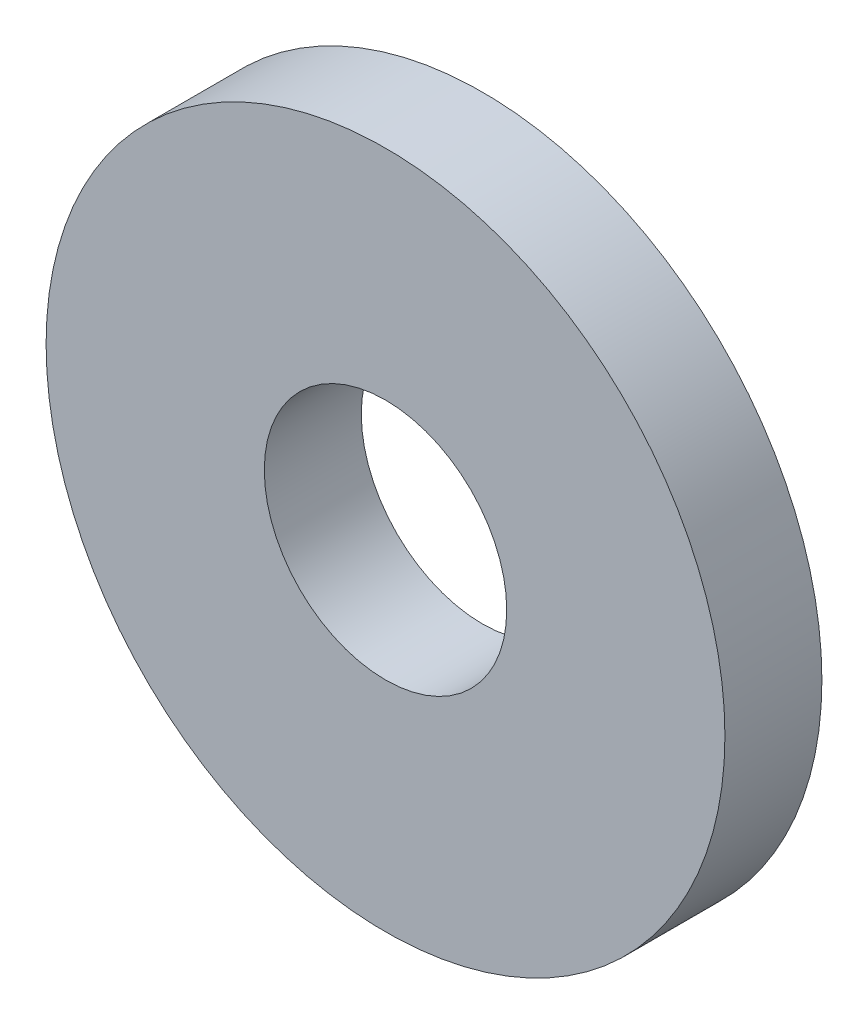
from build123d import *

# Parameters (mm, degrees)
SKETCH1_R           = 14
SKETCH1_R_2         = 5
BOSS_EXTRUDE1_DEPTH = 4


with BuildPart() as part:
    # Sketch1 → Boss-Extrude1 (new body)
    with BuildSketch(Plane.XY):
        Circle(SKETCH1_R)
        Circle(SKETCH1_R_2, mode=Mode.SUBTRACT)
    extrude(amount=BOSS_EXTRUDE1_DEPTH)


solid = part.part
